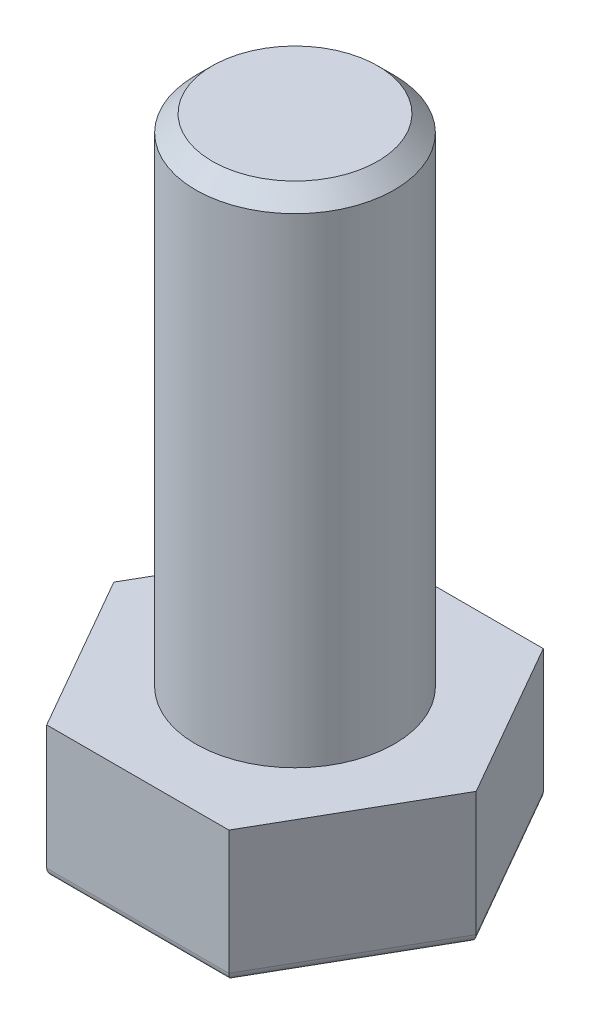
from build123d import *

# Parameters (mm, degrees)
EXTRUSION1_DEPTH = 8
CONG_1_R         = 0.5
ESQUISSE2_R      = 6
EXTRUSION2_DEPTH = 30
CHANFREIN1_SIZE  = 1


with BuildPart() as part:
    # Esquisse1 → Extrusion1 (new body)
    with BuildSketch(Plane(origin=(0, 0, 0), x_dir=(1, 0, 0), z_dir=(0, 1, 0))):
        Polygon((-5.504589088, 9.5), (5.504589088, 9.5), (10.95, 0), (5.504589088, -9.5), (-5.504589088, -9.5), (-10.95, 0), align=None)
    extrude(amount=EXTRUSION1_DEPTH)

    # Cong_1
    cong_1_edges = [part.edges().sort_by_distance(p)[0] for p in [
        (-8.227294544, 0, 4.75),
        (-8.227294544, 0, -4.75),
        (0, 0, -9.5),
        (8.227294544, 0, -4.75),
        (8.227294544, 0, 4.75),
        (0, 0, 9.5),
    ]]
    fillet(cong_1_edges, radius=CONG_1_R)

    # Esquisse2 → Extrusion2 (add)
    with BuildSketch(Plane(origin=(0, 8, 0), x_dir=(-1, 0, 0), z_dir=(0, 1, 0))):
        with Locations(Location((0, 0, 0), (0, 0, 90))):
            Circle(ESQUISSE2_R)
    extrude(amount=EXTRUSION2_DEPTH)

    # Chanfrein1
    chanfrein1_edges = [part.edges().sort_by_distance(p)[0] for p in [
        (0, 38, -6),
    ]]
    chamfer(chanfrein1_edges, length=CHANFREIN1_SIZE)


solid = part.part
